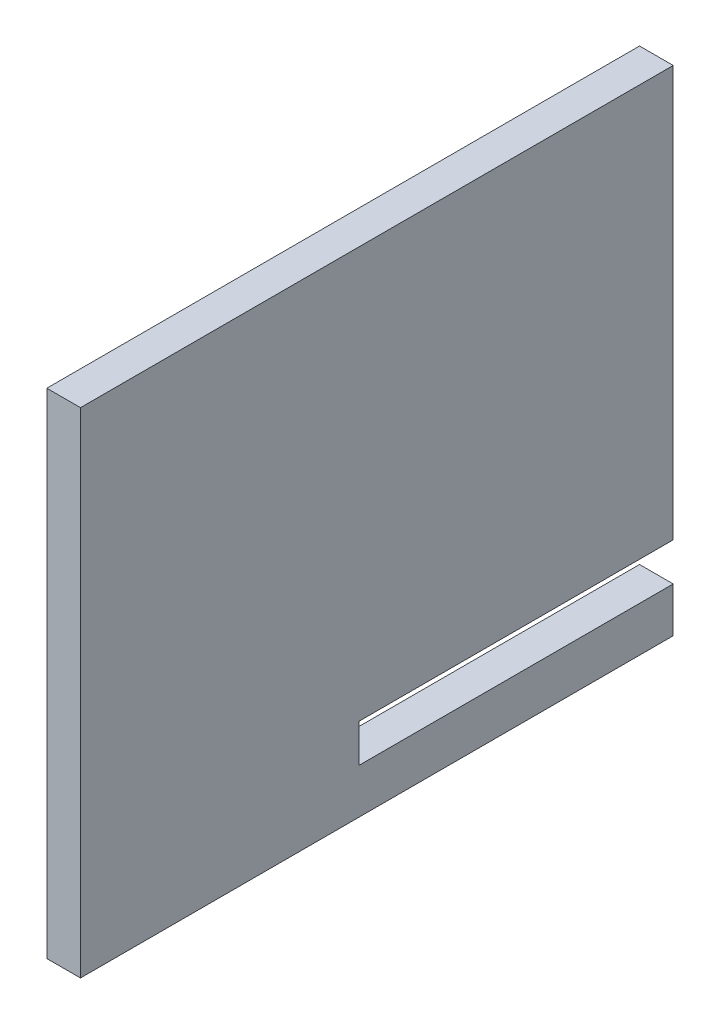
from build123d import *

# Parameters (mm, degrees)
CROQUIS16_W             = 1.5
CROQUIS16_H             = 79.5
SALIENTE_EXTRUIR9_DEPTH = 26.4
CROQUIS20_W             = 14
CROQUIS20_H             = 1.7
CORTAR_EXTRUIR2_DEPTH   = 1.5
CROQUIS21_W             = 26.4
CROQUIS21_H             = 16.9
CROQUIS21_H_2           = 40.6
CORTAR_EXTRUIR3_DEPTH   = 1.5


with BuildPart() as part:
    # Croquis16 → Saliente-Extruir9 (new body)
    with BuildSketch(Plane.XY):
        with Locations((-17.5, 0)):
            Rectangle(CROQUIS16_W, CROQUIS16_H)
    extrude(amount=SALIENTE_EXTRUIR9_DEPTH)

    # Croquis20 → Cortar-Extruir2 (cut)
    with BuildSketch(Plane(origin=(-16.75, 0, 0), x_dir=(0, 0, -1), z_dir=(1, 0, 0))):
        with Locations((-7, -20)):
            Rectangle(CROQUIS20_W, CROQUIS20_H)
        with Locations((-7, 0)):
            Rectangle(CROQUIS20_W, CROQUIS20_H)
        with Locations((-7, 20)):
            Rectangle(CROQUIS20_W, CROQUIS20_H)
    extrude(amount=-CORTAR_EXTRUIR2_DEPTH, mode=Mode.SUBTRACT)

    # Croquis21 → Cortar-Extruir3 (cut)
    with BuildSketch(Plane(origin=(-16.75, 0, 0), x_dir=(0, 0, -1), z_dir=(1, 0, 0))):
        with Locations((-13.2, -31.3)):
            Rectangle(CROQUIS21_W, CROQUIS21_H)
        with Locations((-13.2, 19.45)):
            Rectangle(CROQUIS21_W, CROQUIS21_H_2)
    extrude(amount=-CORTAR_EXTRUIR3_DEPTH, mode=Mode.SUBTRACT)


solid = part.part
